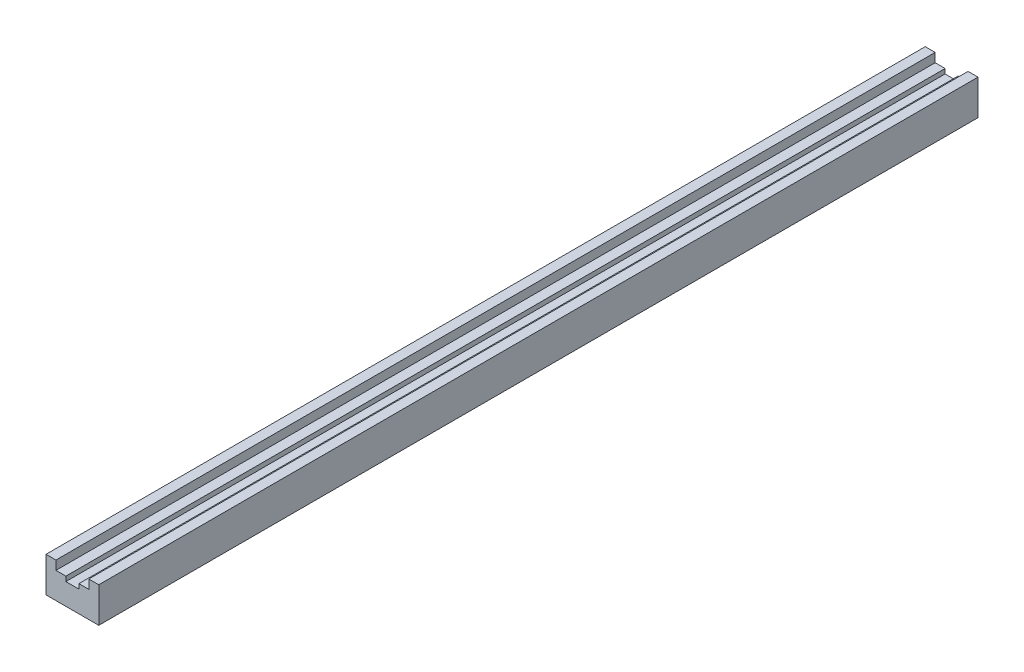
ISO-10303-21;
HEADER;
FILE_DESCRIPTION(('STEP AP214'),'2;1');
FILE_NAME('part.step','',(''),(''),'','','');
FILE_SCHEMA(('AUTOMOTIVE_DESIGN { 1 0 10303 214 1 1 1 1 }'));
ENDSEC;
DATA;
#1=APPLICATION_CONTEXT('core data for automotive mechanical design processes');
#2=APPLICATION_PROTOCOL_DEFINITION('international standard','automotive_design',2000,#1);
#3=PRODUCT_CONTEXT('',#1,'mechanical');
#4=PRODUCT('Part','Part','',(#3));
#5=PRODUCT_RELATED_PRODUCT_CATEGORY('part','',(#4));
#6=PRODUCT_DEFINITION_FORMATION('','',#4);
#7=PRODUCT_DEFINITION_CONTEXT('part definition',#1,'design');
#8=PRODUCT_DEFINITION('design','',#6,#7);
#9=PRODUCT_DEFINITION_SHAPE('','',#8);
#10=(LENGTH_UNIT() NAMED_UNIT(*) SI_UNIT(.MILLI.,.METRE.));
#11=(NAMED_UNIT(*) PLANE_ANGLE_UNIT() SI_UNIT($,.RADIAN.));
#12=(NAMED_UNIT(*) SI_UNIT($,.STERADIAN.) SOLID_ANGLE_UNIT());
#13=UNCERTAINTY_MEASURE_WITH_UNIT(LENGTH_MEASURE(1.E-05),#10,'distance_accuracy_value','');
#14=(GEOMETRIC_REPRESENTATION_CONTEXT(3) GLOBAL_UNCERTAINTY_ASSIGNED_CONTEXT((#13)) GLOBAL_UNIT_ASSIGNED_CONTEXT((#10,
#11,#12)) REPRESENTATION_CONTEXT('',''));
#15=CARTESIAN_POINT('',(0.,0.,0.));
#16=DIRECTION('',(0.,0.,1.));
#17=DIRECTION('',(1.,0.,0.));
#18=AXIS2_PLACEMENT_3D('',#15,#16,#17);
#19=CARTESIAN_POINT('',(-15.,20.,0.));
#20=DIRECTION('',(-1.,0.,0.));
#21=DIRECTION('',(0.,0.,1.));
#22=AXIS2_PLACEMENT_3D('',#19,#20,#21);
#23=PLANE('',#22);
#24=DIRECTION('',(0.,0.,1.));
#25=VECTOR('',#24,1.);
#26=CARTESIAN_POINT('',(-15.,20.,0.));
#27=LINE('',#26,#25);
#28=CARTESIAN_POINT('',(-15.,20.,0.));
#29=VERTEX_POINT('',#28);
#30=CARTESIAN_POINT('',(-15.,20.,500.));
#31=VERTEX_POINT('',#30);
#32=EDGE_CURVE('E9',#29,#31,#27,.T.);
#33=ORIENTED_EDGE('',*,*,#32,.F.);
#34=DIRECTION('',(0.,-1.,0.));
#35=VECTOR('',#34,1.);
#36=CARTESIAN_POINT('',(-15.,20.,0.));
#37=LINE('',#36,#35);
#38=CARTESIAN_POINT('',(-15.,0.,0.));
#39=VERTEX_POINT('',#38);
#40=EDGE_CURVE('E103',#29,#39,#37,.T.);
#41=ORIENTED_EDGE('',*,*,#40,.T.);
#42=DIRECTION('',(0.,0.,1.));
#43=VECTOR('',#42,1.);
#44=CARTESIAN_POINT('',(-15.,0.,0.));
#45=LINE('',#44,#43);
#46=CARTESIAN_POINT('',(-15.,0.,500.));
#47=VERTEX_POINT('',#46);
#48=EDGE_CURVE('E99',#39,#47,#45,.T.);
#49=ORIENTED_EDGE('',*,*,#48,.T.);
#50=DIRECTION('',(0.,-1.,0.));
#51=VECTOR('',#50,1.);
#52=CARTESIAN_POINT('',(-15.,20.,500.));
#53=LINE('',#52,#51);
#54=EDGE_CURVE('E101',#31,#47,#53,.T.);
#55=ORIENTED_EDGE('',*,*,#54,.F.);
#56=EDGE_LOOP('',(#33,#41,#49,#55));
#57=FACE_BOUND('',#56,.T.);
#58=ADVANCED_FACE('F14',(#57),#23,.T.);
#59=CARTESIAN_POINT('',(-15.,20.,0.));
#60=DIRECTION('',(0.,-1.,0.));
#61=DIRECTION('',(0.,0.,-1.));
#62=AXIS2_PLACEMENT_3D('',#59,#60,#61);
#63=PLANE('',#62);
#64=DIRECTION('',(0.,0.,1.));
#65=VECTOR('',#64,1.);
#66=CARTESIAN_POINT('',(-9.35,20.,0.));
#67=LINE('',#66,#65);
#68=CARTESIAN_POINT('',(-9.35,20.,0.));
#69=VERTEX_POINT('',#68);
#70=CARTESIAN_POINT('',(-9.35,20.,500.));
#71=VERTEX_POINT('',#70);
#72=EDGE_CURVE('E22',#69,#71,#67,.T.);
#73=ORIENTED_EDGE('',*,*,#72,.F.);
#74=DIRECTION('',(1.,0.,0.));
#75=VECTOR('',#74,1.);
#76=CARTESIAN_POINT('',(-15.,20.,0.));
#77=LINE('',#76,#75);
#78=EDGE_CURVE('E109',#29,#69,#77,.T.);
#79=ORIENTED_EDGE('',*,*,#78,.F.);
#80=ORIENTED_EDGE('',*,*,#32,.T.);
#81=DIRECTION('',(1.,0.,0.));
#82=VECTOR('',#81,1.);
#83=CARTESIAN_POINT('',(-15.,20.,500.));
#84=LINE('',#83,#82);
#85=EDGE_CURVE('E118',#31,#71,#84,.T.);
#86=ORIENTED_EDGE('',*,*,#85,.T.);
#87=EDGE_LOOP('',(#73,#79,#80,#86));
#88=FACE_BOUND('',#87,.T.);
#89=ADVANCED_FACE('F16',(#88),#63,.F.);
#90=CARTESIAN_POINT('',(-9.35,20.,0.));
#91=DIRECTION('',(-1.,0.,0.));
#92=DIRECTION('',(0.,0.,1.));
#93=AXIS2_PLACEMENT_3D('',#90,#91,#92);
#94=PLANE('',#93);
#95=DIRECTION('',(0.,0.,1.));
#96=VECTOR('',#95,1.);
#97=CARTESIAN_POINT('',(-9.35,14.9,0.));
#98=LINE('',#97,#96);
#99=CARTESIAN_POINT('',(-9.35,14.9,0.));
#100=VERTEX_POINT('',#99);
#101=CARTESIAN_POINT('',(-9.35,14.9,500.));
#102=VERTEX_POINT('',#101);
#103=EDGE_CURVE('E197',#100,#102,#98,.T.);
#104=ORIENTED_EDGE('',*,*,#103,.F.);
#105=DIRECTION('',(0.,-1.,0.));
#106=VECTOR('',#105,1.);
#107=CARTESIAN_POINT('',(-9.35,20.,0.));
#108=LINE('',#107,#106);
#109=EDGE_CURVE('E177',#69,#100,#108,.T.);
#110=ORIENTED_EDGE('',*,*,#109,.F.);
#111=ORIENTED_EDGE('',*,*,#72,.T.);
#112=DIRECTION('',(0.,-1.,0.));
#113=VECTOR('',#112,1.);
#114=CARTESIAN_POINT('',(-9.35,20.,500.));
#115=LINE('',#114,#113);
#116=EDGE_CURVE('E146',#71,#102,#115,.T.);
#117=ORIENTED_EDGE('',*,*,#116,.T.);
#118=EDGE_LOOP('',(#104,#110,#111,#117));
#119=FACE_BOUND('',#118,.T.);
#120=ADVANCED_FACE('F199',(#119),#94,.F.);
#121=CARTESIAN_POINT('',(-9.35,14.9,0.));
#122=DIRECTION('',(0.,-1.,0.));
#123=DIRECTION('',(0.,0.,-1.));
#124=AXIS2_PLACEMENT_3D('',#121,#122,#123);
#125=PLANE('',#124);
#126=DIRECTION('',(0.,0.,1.));
#127=VECTOR('',#126,1.);
#128=CARTESIAN_POINT('',(-3.7,14.9,0.));
#129=LINE('',#128,#127);
#130=CARTESIAN_POINT('',(-3.7,14.9,0.));
#131=VERTEX_POINT('',#130);
#132=CARTESIAN_POINT('',(-3.7,14.9,500.));
#133=VERTEX_POINT('',#132);
#134=EDGE_CURVE('E195',#131,#133,#129,.T.);
#135=ORIENTED_EDGE('',*,*,#134,.F.);
#136=DIRECTION('',(1.,0.,0.));
#137=VECTOR('',#136,1.);
#138=CARTESIAN_POINT('',(-9.35,14.9,0.));
#139=LINE('',#138,#137);
#140=EDGE_CURVE('E174',#100,#131,#139,.T.);
#141=ORIENTED_EDGE('',*,*,#140,.F.);
#142=ORIENTED_EDGE('',*,*,#103,.T.);
#143=DIRECTION('',(1.,0.,0.));
#144=VECTOR('',#143,1.);
#145=CARTESIAN_POINT('',(-9.35,14.9,500.));
#146=LINE('',#145,#144);
#147=EDGE_CURVE('E143',#102,#133,#146,.T.);
#148=ORIENTED_EDGE('',*,*,#147,.T.);
#149=EDGE_LOOP('',(#135,#141,#142,#148));
#150=FACE_BOUND('',#149,.T.);
#151=ADVANCED_FACE('F231',(#150),#125,.F.);
#152=CARTESIAN_POINT('',(-3.7,14.9,0.));
#153=DIRECTION('',(-1.,0.,0.));
#154=DIRECTION('',(0.,-1.,0.));
#155=AXIS2_PLACEMENT_3D('',#152,#153,#154);
#156=PLANE('',#155);
#157=DIRECTION('',(0.,0.,1.));
#158=VECTOR('',#157,1.);
#159=CARTESIAN_POINT('',(-3.69999999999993,12.2,0.));
#160=LINE('',#159,#158);
#161=CARTESIAN_POINT('',(-3.69999999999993,12.2,0.));
#162=VERTEX_POINT('',#161);
#163=CARTESIAN_POINT('',(-3.69999999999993,12.2,500.));
#164=VERTEX_POINT('',#163);
#165=EDGE_CURVE('E193',#162,#164,#160,.T.);
#166=ORIENTED_EDGE('',*,*,#165,.F.);
#167=DIRECTION('',(0.,-1.,0.));
#168=VECTOR('',#167,1.);
#169=CARTESIAN_POINT('',(-3.7,14.9,0.));
#170=LINE('',#169,#168);
#171=EDGE_CURVE('E171',#131,#162,#170,.T.);
#172=ORIENTED_EDGE('',*,*,#171,.F.);
#173=ORIENTED_EDGE('',*,*,#134,.T.);
#174=DIRECTION('',(0.,-1.,0.));
#175=VECTOR('',#174,1.);
#176=CARTESIAN_POINT('',(-3.7,14.9,500.));
#177=LINE('',#176,#175);
#178=EDGE_CURVE('E140',#133,#164,#177,.T.);
#179=ORIENTED_EDGE('',*,*,#178,.T.);
#180=EDGE_LOOP('',(#166,#172,#173,#179));
#181=FACE_BOUND('',#180,.T.);
#182=ADVANCED_FACE('F229',(#181),#156,.F.);
#183=CARTESIAN_POINT('',(-3.69999999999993,12.2,0.));
#184=DIRECTION('',(0.,-1.,0.));
#185=DIRECTION('',(0.,0.,-1.));
#186=AXIS2_PLACEMENT_3D('',#183,#184,#185);
#187=PLANE('',#186);
#188=DIRECTION('',(0.,0.,1.));
#189=VECTOR('',#188,1.);
#190=CARTESIAN_POINT('',(3.70000000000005,12.2,0.));
#191=LINE('',#190,#189);
#192=CARTESIAN_POINT('',(3.70000000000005,12.2,0.));
#193=VERTEX_POINT('',#192);
#194=CARTESIAN_POINT('',(3.70000000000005,12.2,500.));
#195=VERTEX_POINT('',#194);
#196=EDGE_CURVE('E191',#193,#195,#191,.T.);
#197=ORIENTED_EDGE('',*,*,#196,.F.);
#198=DIRECTION('',(1.,0.,0.));
#199=VECTOR('',#198,1.);
#200=CARTESIAN_POINT('',(-3.69999999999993,12.2,0.));
#201=LINE('',#200,#199);
#202=EDGE_CURVE('E168',#162,#193,#201,.T.);
#203=ORIENTED_EDGE('',*,*,#202,.F.);
#204=ORIENTED_EDGE('',*,*,#165,.T.);
#205=DIRECTION('',(1.,0.,0.));
#206=VECTOR('',#205,1.);
#207=CARTESIAN_POINT('',(-3.69999999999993,12.2,500.));
#208=LINE('',#207,#206);
#209=EDGE_CURVE('E137',#164,#195,#208,.T.);
#210=ORIENTED_EDGE('',*,*,#209,.T.);
#211=EDGE_LOOP('',(#197,#203,#204,#210));
#212=FACE_BOUND('',#211,.T.);
#213=ADVANCED_FACE('F225',(#212),#187,.F.);
#214=CARTESIAN_POINT('',(3.70000000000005,14.9,0.));
#215=DIRECTION('',(-1.,0.,0.));
#216=DIRECTION('',(0.,0.,1.));
#217=AXIS2_PLACEMENT_3D('',#214,#215,#216);
#218=PLANE('',#217);
#219=DIRECTION('',(0.,0.,1.));
#220=VECTOR('',#219,1.);
#221=CARTESIAN_POINT('',(3.70000000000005,14.9,0.));
#222=LINE('',#221,#220);
#223=CARTESIAN_POINT('',(3.70000000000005,14.9,0.));
#224=VERTEX_POINT('',#223);
#225=CARTESIAN_POINT('',(3.70000000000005,14.9,500.));
#226=VERTEX_POINT('',#225);
#227=EDGE_CURVE('E189',#224,#226,#222,.T.);
#228=ORIENTED_EDGE('',*,*,#227,.F.);
#229=DIRECTION('',(0.,-1.,0.));
#230=VECTOR('',#229,1.);
#231=CARTESIAN_POINT('',(3.70000000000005,14.9,0.));
#232=LINE('',#231,#230);
#233=EDGE_CURVE('E165',#224,#193,#232,.T.);
#234=ORIENTED_EDGE('',*,*,#233,.T.);
#235=ORIENTED_EDGE('',*,*,#196,.T.);
#236=DIRECTION('',(0.,-1.,0.));
#237=VECTOR('',#236,1.);
#238=CARTESIAN_POINT('',(3.70000000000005,14.9,500.));
#239=LINE('',#238,#237);
#240=EDGE_CURVE('E134',#226,#195,#239,.T.);
#241=ORIENTED_EDGE('',*,*,#240,.F.);
#242=EDGE_LOOP('',(#228,#234,#235,#241));
#243=FACE_BOUND('',#242,.T.);
#244=ADVANCED_FACE('F222',(#243),#218,.T.);
#245=CARTESIAN_POINT('',(3.70000000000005,14.9,0.));
#246=DIRECTION('',(0.,-1.,0.));
#247=DIRECTION('',(0.,0.,-1.));
#248=AXIS2_PLACEMENT_3D('',#245,#246,#247);
#249=PLANE('',#248);
#250=DIRECTION('',(0.,0.,1.));
#251=VECTOR('',#250,1.);
#252=CARTESIAN_POINT('',(9.35,14.9,0.));
#253=LINE('',#252,#251);
#254=CARTESIAN_POINT('',(9.35,14.9,0.));
#255=VERTEX_POINT('',#254);
#256=CARTESIAN_POINT('',(9.35,14.9,500.));
#257=VERTEX_POINT('',#256);
#258=EDGE_CURVE('E187',#255,#257,#253,.T.);
#259=ORIENTED_EDGE('',*,*,#258,.F.);
#260=DIRECTION('',(1.,0.,0.));
#261=VECTOR('',#260,1.);
#262=CARTESIAN_POINT('',(3.70000000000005,14.9,0.));
#263=LINE('',#262,#261);
#264=EDGE_CURVE('E162',#224,#255,#263,.T.);
#265=ORIENTED_EDGE('',*,*,#264,.F.);
#266=ORIENTED_EDGE('',*,*,#227,.T.);
#267=DIRECTION('',(1.,0.,0.));
#268=VECTOR('',#267,1.);
#269=CARTESIAN_POINT('',(3.70000000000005,14.9,500.));
#270=LINE('',#269,#268);
#271=EDGE_CURVE('E131',#226,#257,#270,.T.);
#272=ORIENTED_EDGE('',*,*,#271,.T.);
#273=EDGE_LOOP('',(#259,#265,#266,#272));
#274=FACE_BOUND('',#273,.T.);
#275=ADVANCED_FACE('F218',(#274),#249,.F.);
#276=CARTESIAN_POINT('',(9.35,20.,0.));
#277=DIRECTION('',(-1.,0.,0.));
#278=DIRECTION('',(0.,0.,1.));
#279=AXIS2_PLACEMENT_3D('',#276,#277,#278);
#280=PLANE('',#279);
#281=DIRECTION('',(0.,0.,1.));
#282=VECTOR('',#281,1.);
#283=CARTESIAN_POINT('',(9.35,20.,0.));
#284=LINE('',#283,#282);
#285=CARTESIAN_POINT('',(9.35,20.,0.));
#286=VERTEX_POINT('',#285);
#287=CARTESIAN_POINT('',(9.35,20.,500.));
#288=VERTEX_POINT('',#287);
#289=EDGE_CURVE('E185',#286,#288,#284,.T.);
#290=ORIENTED_EDGE('',*,*,#289,.F.);
#291=DIRECTION('',(0.,-1.,0.));
#292=VECTOR('',#291,1.);
#293=CARTESIAN_POINT('',(9.35,20.,0.));
#294=LINE('',#293,#292);
#295=EDGE_CURVE('E159',#286,#255,#294,.T.);
#296=ORIENTED_EDGE('',*,*,#295,.T.);
#297=ORIENTED_EDGE('',*,*,#258,.T.);
#298=DIRECTION('',(0.,-1.,0.));
#299=VECTOR('',#298,1.);
#300=CARTESIAN_POINT('',(9.35,20.,500.));
#301=LINE('',#300,#299);
#302=EDGE_CURVE('E128',#288,#257,#301,.T.);
#303=ORIENTED_EDGE('',*,*,#302,.F.);
#304=EDGE_LOOP('',(#290,#296,#297,#303));
#305=FACE_BOUND('',#304,.T.);
#306=ADVANCED_FACE('F214',(#305),#280,.T.);
#307=CARTESIAN_POINT('',(9.35,20.,0.));
#308=DIRECTION('',(0.,-1.,0.));
#309=DIRECTION('',(0.,0.,-1.));
#310=AXIS2_PLACEMENT_3D('',#307,#308,#309);
#311=PLANE('',#310);
#312=DIRECTION('',(0.,0.,1.));
#313=VECTOR('',#312,1.);
#314=CARTESIAN_POINT('',(15.,20.,0.));
#315=LINE('',#314,#313);
#316=CARTESIAN_POINT('',(15.,20.,0.));
#317=VERTEX_POINT('',#316);
#318=CARTESIAN_POINT('',(15.,20.,500.));
#319=VERTEX_POINT('',#318);
#320=EDGE_CURVE('E183',#317,#319,#315,.T.);
#321=ORIENTED_EDGE('',*,*,#320,.F.);
#322=DIRECTION('',(1.,0.,0.));
#323=VECTOR('',#322,1.);
#324=CARTESIAN_POINT('',(9.35,20.,0.));
#325=LINE('',#324,#323);
#326=EDGE_CURVE('E156',#286,#317,#325,.T.);
#327=ORIENTED_EDGE('',*,*,#326,.F.);
#328=ORIENTED_EDGE('',*,*,#289,.T.);
#329=DIRECTION('',(1.,0.,0.));
#330=VECTOR('',#329,1.);
#331=CARTESIAN_POINT('',(9.35,20.,500.));
#332=LINE('',#331,#330);
#333=EDGE_CURVE('E123',#288,#319,#332,.T.);
#334=ORIENTED_EDGE('',*,*,#333,.T.);
#335=EDGE_LOOP('',(#321,#327,#328,#334));
#336=FACE_BOUND('',#335,.T.);
#337=ADVANCED_FACE('F212',(#336),#311,.F.);
#338=CARTESIAN_POINT('',(15.,20.,0.));
#339=DIRECTION('',(-1.,0.,0.));
#340=DIRECTION('',(0.,0.,1.));
#341=AXIS2_PLACEMENT_3D('',#338,#339,#340);
#342=PLANE('',#341);
#343=DIRECTION('',(0.,0.,1.));
#344=VECTOR('',#343,1.);
#345=CARTESIAN_POINT('',(15.,0.,0.));
#346=LINE('',#345,#344);
#347=CARTESIAN_POINT('',(15.,0.,0.));
#348=VERTEX_POINT('',#347);
#349=CARTESIAN_POINT('',(15.,0.,500.));
#350=VERTEX_POINT('',#349);
#351=EDGE_CURVE('E108',#348,#350,#346,.T.);
#352=ORIENTED_EDGE('',*,*,#351,.F.);
#353=DIRECTION('',(0.,-1.,0.));
#354=VECTOR('',#353,1.);
#355=CARTESIAN_POINT('',(15.,20.,0.));
#356=LINE('',#355,#354);
#357=EDGE_CURVE('E153',#317,#348,#356,.T.);
#358=ORIENTED_EDGE('',*,*,#357,.F.);
#359=ORIENTED_EDGE('',*,*,#320,.T.);
#360=DIRECTION('',(0.,-1.,0.));
#361=VECTOR('',#360,1.);
#362=CARTESIAN_POINT('',(15.,20.,500.));
#363=LINE('',#362,#361);
#364=EDGE_CURVE('E121',#319,#350,#363,.T.);
#365=ORIENTED_EDGE('',*,*,#364,.T.);
#366=EDGE_LOOP('',(#352,#358,#359,#365));
#367=FACE_BOUND('',#366,.T.);
#368=ADVANCED_FACE('F208',(#367),#342,.F.);
#369=CARTESIAN_POINT('',(-15.,0.,0.));
#370=DIRECTION('',(0.,-1.,0.));
#371=DIRECTION('',(1.,0.,0.));
#372=AXIS2_PLACEMENT_3D('',#369,#370,#371);
#373=PLANE('',#372);
#374=DIRECTION('',(1.,0.,0.));
#375=VECTOR('',#374,1.);
#376=CARTESIAN_POINT('',(-15.,0.,0.));
#377=LINE('',#376,#375);
#378=EDGE_CURVE('E151',#39,#348,#377,.T.);
#379=ORIENTED_EDGE('',*,*,#378,.T.);
#380=ORIENTED_EDGE('',*,*,#351,.T.);
#381=DIRECTION('',(1.,0.,0.));
#382=VECTOR('',#381,1.);
#383=CARTESIAN_POINT('',(-15.,0.,500.));
#384=LINE('',#383,#382);
#385=EDGE_CURVE('E115',#47,#350,#384,.T.);
#386=ORIENTED_EDGE('',*,*,#385,.F.);
#387=ORIENTED_EDGE('',*,*,#48,.F.);
#388=EDGE_LOOP('',(#379,#380,#386,#387));
#389=FACE_BOUND('',#388,.T.);
#390=ADVANCED_FACE('F120',(#389),#373,.T.);
#391=CARTESIAN_POINT('',(-15.,20.,0.));
#392=DIRECTION('',(0.,0.,1.));
#393=DIRECTION('',(1.,0.,0.));
#394=AXIS2_PLACEMENT_3D('',#391,#392,#393);
#395=PLANE('',#394);
#396=ORIENTED_EDGE('',*,*,#40,.F.);
#397=ORIENTED_EDGE('',*,*,#78,.T.);
#398=ORIENTED_EDGE('',*,*,#109,.T.);
#399=ORIENTED_EDGE('',*,*,#140,.T.);
#400=ORIENTED_EDGE('',*,*,#171,.T.);
#401=ORIENTED_EDGE('',*,*,#202,.T.);
#402=ORIENTED_EDGE('',*,*,#233,.F.);
#403=ORIENTED_EDGE('',*,*,#264,.T.);
#404=ORIENTED_EDGE('',*,*,#295,.F.);
#405=ORIENTED_EDGE('',*,*,#326,.T.);
#406=ORIENTED_EDGE('',*,*,#357,.T.);
#407=ORIENTED_EDGE('',*,*,#378,.F.);
#408=EDGE_LOOP('',(#396,#397,#398,#399,#400,#401,#402,#403,#404,#405,#406,#407));
#409=FACE_BOUND('',#408,.T.);
#410=ADVANCED_FACE('F203',(#409),#395,.F.);
#411=CARTESIAN_POINT('',(-15.,20.,500.));
#412=DIRECTION('',(0.,0.,1.));
#413=DIRECTION('',(1.,0.,0.));
#414=AXIS2_PLACEMENT_3D('',#411,#412,#413);
#415=PLANE('',#414);
#416=ORIENTED_EDGE('',*,*,#54,.T.);
#417=ORIENTED_EDGE('',*,*,#385,.T.);
#418=ORIENTED_EDGE('',*,*,#364,.F.);
#419=ORIENTED_EDGE('',*,*,#333,.F.);
#420=ORIENTED_EDGE('',*,*,#302,.T.);
#421=ORIENTED_EDGE('',*,*,#271,.F.);
#422=ORIENTED_EDGE('',*,*,#240,.T.);
#423=ORIENTED_EDGE('',*,*,#209,.F.);
#424=ORIENTED_EDGE('',*,*,#178,.F.);
#425=ORIENTED_EDGE('',*,*,#147,.F.);
#426=ORIENTED_EDGE('',*,*,#116,.F.);
#427=ORIENTED_EDGE('',*,*,#85,.F.);
#428=EDGE_LOOP('',(#416,#417,#418,#419,#420,#421,#422,#423,#424,#425,#426,#427));
#429=FACE_BOUND('',#428,.T.);
#430=ADVANCED_FACE('F113',(#429),#415,.T.);
#431=CLOSED_SHELL('',(#58,#89,#120,#151,#182,#213,#244,#275,#306,#337,#368,#390,#410,#430));
#432=MANIFOLD_SOLID_BREP('B1',#431);
#433=ADVANCED_BREP_SHAPE_REPRESENTATION('',(#18,#432),#14);
#434=SHAPE_DEFINITION_REPRESENTATION(#9,#433);
ENDSEC;
END-ISO-10303-21;
